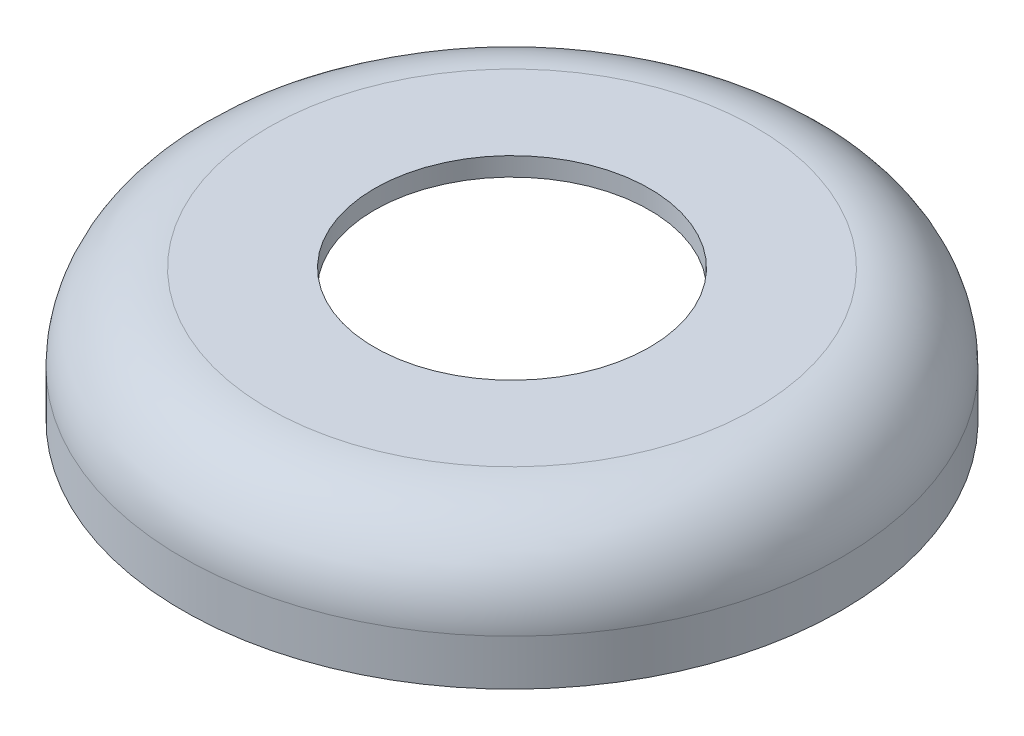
ISO-10303-21;
HEADER;
FILE_DESCRIPTION(('STEP AP214'),'2;1');
FILE_NAME('part.step','',(''),(''),'','','');
FILE_SCHEMA(('AUTOMOTIVE_DESIGN { 1 0 10303 214 1 1 1 1 }'));
ENDSEC;
DATA;
#1=APPLICATION_CONTEXT('core data for automotive mechanical design processes');
#2=APPLICATION_PROTOCOL_DEFINITION('international standard','automotive_design',2000,#1);
#3=PRODUCT_CONTEXT('',#1,'mechanical');
#4=PRODUCT('Part','Part','',(#3));
#5=PRODUCT_RELATED_PRODUCT_CATEGORY('part','',(#4));
#6=PRODUCT_DEFINITION_FORMATION('','',#4);
#7=PRODUCT_DEFINITION_CONTEXT('part definition',#1,'design');
#8=PRODUCT_DEFINITION('design','',#6,#7);
#9=PRODUCT_DEFINITION_SHAPE('','',#8);
#10=(LENGTH_UNIT() NAMED_UNIT(*) SI_UNIT(.MILLI.,.METRE.));
#11=(NAMED_UNIT(*) PLANE_ANGLE_UNIT() SI_UNIT($,.RADIAN.));
#12=(NAMED_UNIT(*) SI_UNIT($,.STERADIAN.) SOLID_ANGLE_UNIT());
#13=UNCERTAINTY_MEASURE_WITH_UNIT(LENGTH_MEASURE(1.E-05),#10,'distance_accuracy_value','');
#14=(GEOMETRIC_REPRESENTATION_CONTEXT(3) GLOBAL_UNCERTAINTY_ASSIGNED_CONTEXT((#13)) GLOBAL_UNIT_ASSIGNED_CONTEXT((#10,
#11,#12)) REPRESENTATION_CONTEXT('',''));
#15=CARTESIAN_POINT('',(0.,0.,0.));
#16=DIRECTION('',(0.,0.,1.));
#17=DIRECTION('',(1.,0.,0.));
#18=AXIS2_PLACEMENT_3D('',#15,#16,#17);
#19=CARTESIAN_POINT('',(0.,0.,0.));
#20=DIRECTION('',(0.,-1.,0.));
#21=DIRECTION('',(1.,0.,0.));
#22=AXIS2_PLACEMENT_3D('',#19,#20,#21);
#23=PLANE('',#22);
#24=CARTESIAN_POINT('',(0.,0.,0.));
#25=DIRECTION('',(0.,1.,0.));
#26=DIRECTION('',(-1.,0.,0.));
#27=AXIS2_PLACEMENT_3D('',#24,#25,#26);
#28=CIRCLE('',#27,4.8);
#29=CARTESIAN_POINT('',(-4.8,0.,0.));
#30=VERTEX_POINT('',#29);
#31=EDGE_CURVE('E49',#30,#30,#28,.T.);
#32=ORIENTED_EDGE('',*,*,#31,.F.);
#33=EDGE_LOOP('',(#32));
#34=FACE_BOUND('',#33,.T.);
#35=CARTESIAN_POINT('',(0.,0.,0.));
#36=DIRECTION('',(0.,1.,0.));
#37=DIRECTION('',(-1.,0.,0.));
#38=AXIS2_PLACEMENT_3D('',#35,#36,#37);
#39=CIRCLE('',#38,8.49999999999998);
#40=CARTESIAN_POINT('',(-8.49999999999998,0.,0.));
#41=VERTEX_POINT('',#40);
#42=EDGE_CURVE('E10',#41,#41,#39,.T.);
#43=ORIENTED_EDGE('',*,*,#42,.T.);
#44=EDGE_LOOP('',(#43));
#45=FACE_BOUND('',#44,.T.);
#46=ADVANCED_FACE('F28',(#34,#45),#23,.F.);
#47=CARTESIAN_POINT('',(0.,-3.,0.));
#48=DIRECTION('',(0.,1.,0.));
#49=DIRECTION('',(-1.,0.,0.));
#50=AXIS2_PLACEMENT_3D('',#47,#48,#49);
#51=TOROIDAL_SURFACE('',#50,8.5,3.);
#52=ORIENTED_EDGE('',*,*,#42,.F.);
#53=EDGE_LOOP('',(#52));
#54=FACE_BOUND('',#53,.T.);
#55=CARTESIAN_POINT('',(0.,-3.00000000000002,0.));
#56=DIRECTION('',(0.,1.,0.));
#57=DIRECTION('',(-1.,0.,0.));
#58=AXIS2_PLACEMENT_3D('',#55,#56,#57);
#59=CIRCLE('',#58,11.5);
#60=CARTESIAN_POINT('',(-11.5,-3.00000000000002,0.));
#61=VERTEX_POINT('',#60);
#62=EDGE_CURVE('E34',#61,#61,#59,.T.);
#63=ORIENTED_EDGE('',*,*,#62,.T.);
#64=EDGE_LOOP('',(#63));
#65=FACE_BOUND('',#64,.T.);
#66=ADVANCED_FACE('F64',(#54,#65),#51,.T.);
#67=CARTESIAN_POINT('',(0.,0.,0.));
#68=DIRECTION('',(0.,1.,0.));
#69=DIRECTION('',(-1.,0.,0.));
#70=AXIS2_PLACEMENT_3D('',#67,#68,#69);
#71=CYLINDRICAL_SURFACE('',#70,11.5);
#72=ORIENTED_EDGE('',*,*,#62,.F.);
#73=EDGE_LOOP('',(#72));
#74=FACE_BOUND('',#73,.T.);
#75=CARTESIAN_POINT('',(0.,-4.6,0.));
#76=DIRECTION('',(0.,1.,0.));
#77=DIRECTION('',(-1.,0.,0.));
#78=AXIS2_PLACEMENT_3D('',#75,#76,#77);
#79=CIRCLE('',#78,11.5);
#80=CARTESIAN_POINT('',(-11.5,-4.6,0.));
#81=VERTEX_POINT('',#80);
#82=EDGE_CURVE('E38',#81,#81,#79,.T.);
#83=ORIENTED_EDGE('',*,*,#82,.T.);
#84=EDGE_LOOP('',(#83));
#85=FACE_BOUND('',#84,.T.);
#86=ADVANCED_FACE('F68',(#74,#85),#71,.T.);
#87=CARTESIAN_POINT('',(0.,-4.6,0.));
#88=DIRECTION('',(0.,1.,0.));
#89=DIRECTION('',(-1.,0.,0.));
#90=AXIS2_PLACEMENT_3D('',#87,#88,#89);
#91=PLANE('',#90);
#92=CARTESIAN_POINT('',(0.,-4.6,0.));
#93=DIRECTION('',(0.,1.,0.));
#94=DIRECTION('',(-1.,0.,0.));
#95=AXIS2_PLACEMENT_3D('',#92,#93,#94);
#96=CIRCLE('',#95,10.85);
#97=CARTESIAN_POINT('',(-10.85,-4.6,0.));
#98=VERTEX_POINT('',#97);
#99=EDGE_CURVE('E45',#98,#98,#96,.T.);
#100=ORIENTED_EDGE('',*,*,#99,.T.);
#101=EDGE_LOOP('',(#100));
#102=FACE_BOUND('',#101,.T.);
#103=ORIENTED_EDGE('',*,*,#82,.F.);
#104=EDGE_LOOP('',(#103));
#105=FACE_BOUND('',#104,.T.);
#106=ADVANCED_FACE('F73',(#102,#105),#91,.F.);
#107=CARTESIAN_POINT('',(0.,-0.65,0.));
#108=DIRECTION('',(0.,-1.,0.));
#109=DIRECTION('',(1.,0.,0.));
#110=AXIS2_PLACEMENT_3D('',#107,#108,#109);
#111=PLANE('',#110);
#112=CARTESIAN_POINT('',(0.,-0.650000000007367,0.));
#113=DIRECTION('',(0.,-1.,0.));
#114=DIRECTION('',(1.,0.,0.));
#115=AXIS2_PLACEMENT_3D('',#112,#113,#114);
#116=CIRCLE('',#115,4.8);
#117=CARTESIAN_POINT('',(-4.8,-0.65000000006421,0.));
#118=VERTEX_POINT('',#117);
#119=EDGE_CURVE('E54',#118,#118,#116,.F.);
#120=ORIENTED_EDGE('',*,*,#119,.T.);
#121=EDGE_LOOP('',(#120));
#122=FACE_BOUND('',#121,.T.);
#123=CARTESIAN_POINT('',(0.,-0.650000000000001,0.));
#124=DIRECTION('',(0.,1.,0.));
#125=DIRECTION('',(-1.,0.,0.));
#126=AXIS2_PLACEMENT_3D('',#123,#124,#125);
#127=CIRCLE('',#126,8.49999999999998);
#128=CARTESIAN_POINT('',(-8.49999999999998,-0.650000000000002,0.));
#129=VERTEX_POINT('',#128);
#130=EDGE_CURVE('E42',#129,#129,#127,.T.);
#131=ORIENTED_EDGE('',*,*,#130,.F.);
#132=EDGE_LOOP('',(#131));
#133=FACE_BOUND('',#132,.T.);
#134=ADVANCED_FACE('F79',(#122,#133),#111,.T.);
#135=CARTESIAN_POINT('',(0.,-3.,0.));
#136=DIRECTION('',(0.,1.,0.));
#137=DIRECTION('',(-1.,0.,0.));
#138=AXIS2_PLACEMENT_3D('',#135,#136,#137);
#139=TOROIDAL_SURFACE('',#138,8.5,2.35);
#140=ORIENTED_EDGE('',*,*,#130,.T.);
#141=EDGE_LOOP('',(#140));
#142=FACE_BOUND('',#141,.T.);
#143=CARTESIAN_POINT('',(0.,-3.00000000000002,0.));
#144=DIRECTION('',(0.,1.,0.));
#145=DIRECTION('',(-1.,0.,0.));
#146=AXIS2_PLACEMENT_3D('',#143,#144,#145);
#147=CIRCLE('',#146,10.85);
#148=CARTESIAN_POINT('',(-10.85,-3.00000000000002,0.));
#149=VERTEX_POINT('',#148);
#150=EDGE_CURVE('E48',#149,#149,#147,.T.);
#151=ORIENTED_EDGE('',*,*,#150,.F.);
#152=EDGE_LOOP('',(#151));
#153=FACE_BOUND('',#152,.T.);
#154=ADVANCED_FACE('F84',(#142,#153),#139,.F.);
#155=CARTESIAN_POINT('',(0.,0.,0.));
#156=DIRECTION('',(0.,1.,0.));
#157=DIRECTION('',(-1.,0.,0.));
#158=AXIS2_PLACEMENT_3D('',#155,#156,#157);
#159=CYLINDRICAL_SURFACE('',#158,10.85);
#160=ORIENTED_EDGE('',*,*,#150,.T.);
#161=EDGE_LOOP('',(#160));
#162=FACE_BOUND('',#161,.T.);
#163=ORIENTED_EDGE('',*,*,#99,.F.);
#164=EDGE_LOOP('',(#163));
#165=FACE_BOUND('',#164,.T.);
#166=ADVANCED_FACE('F81',(#162,#165),#159,.F.);
#167=CARTESIAN_POINT('',(6.12323399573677E-11,-500000.,0.));
#168=DIRECTION('',(0.,1.,0.));
#169=DIRECTION('',(-1.,0.,0.));
#170=AXIS2_PLACEMENT_3D('',#167,#168,#169);
#171=CYLINDRICAL_SURFACE('',#170,4.8);
#172=CARTESIAN_POINT('',(-4.8,0.,0.));
#173=CARTESIAN_POINT('',(-4.8,-0.00677083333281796,0.));
#174=CARTESIAN_POINT('',(-4.8,-0.0135416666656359,0.));
#175=CARTESIAN_POINT('',(-4.8,-0.0270833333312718,0.));
#176=CARTESIAN_POINT('',(-4.8,-0.0338541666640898,0.));
#177=CARTESIAN_POINT('',(-4.8,-0.0473958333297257,0.));
#178=CARTESIAN_POINT('',(-4.8,-0.0541666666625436,0.));
#179=CARTESIAN_POINT('',(-4.8,-0.0677083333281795,0.));
#180=CARTESIAN_POINT('',(-4.8,-0.0744791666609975,0.));
#181=CARTESIAN_POINT('',(-4.8,-0.0880208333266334,0.));
#182=CARTESIAN_POINT('',(-4.8,-0.0947916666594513,0.));
#183=CARTESIAN_POINT('',(-4.8,-0.108333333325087,0.));
#184=CARTESIAN_POINT('',(-4.8,-0.115104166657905,0.));
#185=CARTESIAN_POINT('',(-4.8,-0.128645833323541,0.));
#186=CARTESIAN_POINT('',(-4.8,-0.135416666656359,0.));
#187=CARTESIAN_POINT('',(-4.8,-0.148958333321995,0.));
#188=CARTESIAN_POINT('',(-4.8,-0.155729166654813,0.));
#189=CARTESIAN_POINT('',(-4.8,-0.169270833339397,0.));
#190=CARTESIAN_POINT('',(-4.8,-0.176041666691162,0.));
#191=CARTESIAN_POINT('',(-4.8,-0.189583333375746,0.));
#192=CARTESIAN_POINT('',(-4.8,-0.196354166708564,0.));
#193=CARTESIAN_POINT('',(-4.8,-0.2098958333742,0.));
#194=CARTESIAN_POINT('',(-4.8,-0.216666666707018,0.));
#195=CARTESIAN_POINT('',(-4.8,-0.230208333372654,0.));
#196=CARTESIAN_POINT('',(-4.8,-0.236979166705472,0.));
#197=CARTESIAN_POINT('',(-4.8,-0.250520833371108,0.));
#198=CARTESIAN_POINT('',(-4.8,-0.257291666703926,0.));
#199=CARTESIAN_POINT('',(-4.8,-0.270833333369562,0.));
#200=CARTESIAN_POINT('',(-4.8,-0.277604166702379,0.));
#201=CARTESIAN_POINT('',(-4.8,-0.291145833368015,0.));
#202=CARTESIAN_POINT('',(-4.8,-0.297916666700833,0.));
#203=CARTESIAN_POINT('',(-4.8,-0.311458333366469,0.));
#204=CARTESIAN_POINT('',(-4.8,-0.318229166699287,0.));
#205=CARTESIAN_POINT('',(-4.8,-0.331770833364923,0.));
#206=CARTESIAN_POINT('',(-4.8,-0.338541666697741,0.));
#207=CARTESIAN_POINT('',(-4.8,-0.352083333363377,0.));
#208=CARTESIAN_POINT('',(-4.8,-0.358854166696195,0.));
#209=CARTESIAN_POINT('',(-4.8,-0.372395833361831,0.));
#210=CARTESIAN_POINT('',(-4.8,-0.379166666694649,0.));
#211=CARTESIAN_POINT('',(-4.8,-0.392708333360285,0.));
#212=CARTESIAN_POINT('',(-4.8,-0.399479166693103,0.));
#213=CARTESIAN_POINT('',(-4.8,-0.413020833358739,0.));
#214=CARTESIAN_POINT('',(-4.8,-0.419791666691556,0.));
#215=CARTESIAN_POINT('',(-4.8,-0.433333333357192,0.));
#216=CARTESIAN_POINT('',(-4.8,-0.44010416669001,0.));
#217=CARTESIAN_POINT('',(-4.8,-0.453645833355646,0.));
#218=CARTESIAN_POINT('',(-4.8,-0.460416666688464,0.));
#219=CARTESIAN_POINT('',(-4.8,-0.473958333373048,0.));
#220=CARTESIAN_POINT('',(-4.8,-0.480729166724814,0.));
#221=CARTESIAN_POINT('',(-4.8,-0.494270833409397,0.));
#222=CARTESIAN_POINT('',(-4.8,-0.501041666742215,0.));
#223=CARTESIAN_POINT('',(-4.8,-0.514583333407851,0.));
#224=CARTESIAN_POINT('',(-4.8,-0.521354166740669,0.));
#225=CARTESIAN_POINT('',(-4.8,-0.534895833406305,0.));
#226=CARTESIAN_POINT('',(-4.8,-0.541666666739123,0.));
#227=CARTESIAN_POINT('',(-4.8,-0.555208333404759,0.));
#228=CARTESIAN_POINT('',(-4.8,-0.561979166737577,0.));
#229=CARTESIAN_POINT('',(-4.8,-0.575520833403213,0.));
#230=CARTESIAN_POINT('',(-4.8,-0.582291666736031,0.));
#231=CARTESIAN_POINT('',(-4.8,-0.595833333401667,0.));
#232=CARTESIAN_POINT('',(-4.8,-0.602604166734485,0.));
#233=CARTESIAN_POINT('',(-4.8,-0.616145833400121,0.));
#234=CARTESIAN_POINT('',(-4.8,-0.622916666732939,0.));
#235=CARTESIAN_POINT('',(-4.8,-0.636458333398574,0.));
#236=CARTESIAN_POINT('',(-4.8,-0.643229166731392,0.));
#237=CARTESIAN_POINT('',(-4.8,-0.65000000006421,0.));
#238=B_SPLINE_CURVE_WITH_KNOTS('',3,(#172,#173,#174,#175,#176,#177,#178,#179,#180,#181,#182,
#183,#184,#185,#186,#187,#188,#189,#190,#191,#192,#193,#194,#195,#196,#197,#198,#199,#200,#201,
#202,#203,#204,#205,#206,#207,#208,#209,#210,#211,#212,#213,#214,#215,#216,#217,#218,#219,#220,
#221,#222,#223,#224,#225,#226,#227,#228,#229,#230,#231,#232,#233,#234,#235,#236,#237),
.UNSPECIFIED.,.F.,.F.,(4,2,2,2,2,2,2,2,2,2,2,2,2,2,2,2,2,2,2,2,2,2,2,2,2,2,2,2,2,2,2,2,4),(0.,
0.0203124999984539,0.0406249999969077,0.0609374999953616,0.0812499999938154,0.101562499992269,
0.121874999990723,0.142187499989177,0.162499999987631,0.182812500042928,0.203125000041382,
0.223437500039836,0.24375000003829,0.264062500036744,0.284375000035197,0.304687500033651,
0.325000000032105,0.345312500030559,0.365625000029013,0.385937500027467,0.406250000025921,
0.426562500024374,0.446875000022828,0.467187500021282,0.487500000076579,0.507812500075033,
0.528125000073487,0.548437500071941,0.568750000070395,0.589062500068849,0.609375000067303,
0.629687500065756,0.65000000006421),.UNSPECIFIED.);
#239=EDGE_CURVE('BSEAM60',#30,#118,#238,.T.);
#240=ORIENTED_EDGE('',*,*,#31,.T.);
#241=ORIENTED_EDGE('',*,*,#119,.F.);
#242=ORIENTED_EDGE('',*,*,#239,.T.);
#243=ORIENTED_EDGE('',*,*,#239,.F.);
#244=EDGE_LOOP('',(#240,#242,#241,#243));
#245=FACE_BOUND('',#244,.T.);
#246=ADVANCED_FACE('F60',(#245),#171,.F.);
#247=CLOSED_SHELL('',(#46,#66,#86,#106,#134,#154,#166,#246));
#248=MANIFOLD_SOLID_BREP('B2',#247);
#249=ADVANCED_BREP_SHAPE_REPRESENTATION('',(#18,#248),#14);
#250=SHAPE_DEFINITION_REPRESENTATION(#9,#249);
ENDSEC;
END-ISO-10303-21;
